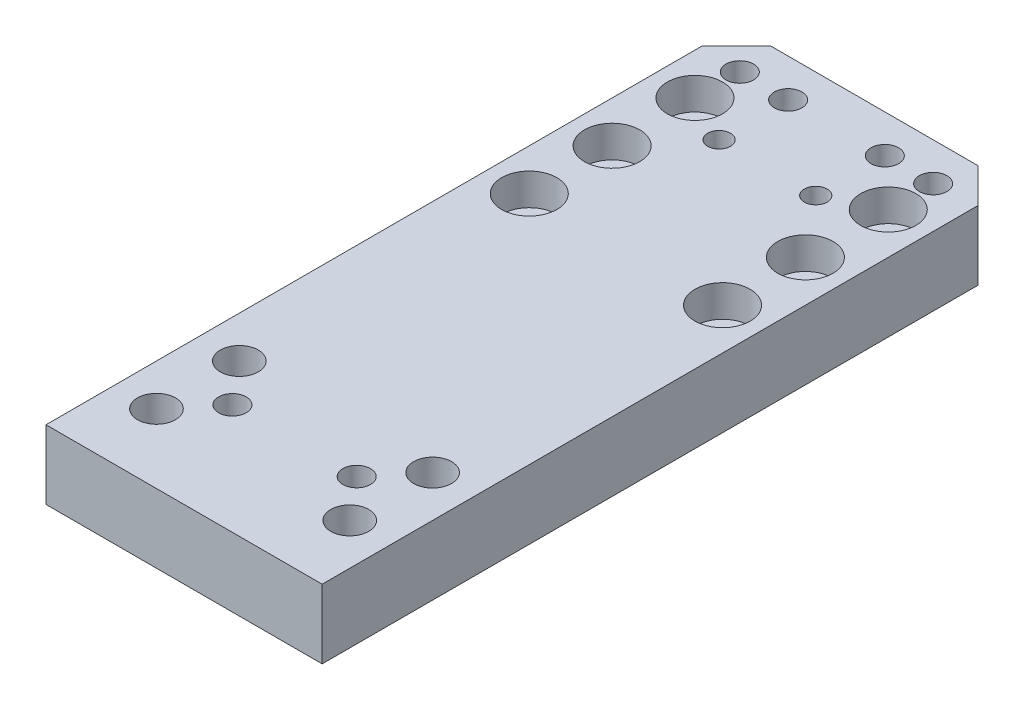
ISO-10303-21;
HEADER;
FILE_DESCRIPTION(('STEP AP214'),'2;1');
FILE_NAME('part.step','',(''),(''),'','','');
FILE_SCHEMA(('AUTOMOTIVE_DESIGN { 1 0 10303 214 1 1 1 1 }'));
ENDSEC;
DATA;
#1=APPLICATION_CONTEXT('core data for automotive mechanical design processes');
#2=APPLICATION_PROTOCOL_DEFINITION('international standard','automotive_design',2000,#1);
#3=PRODUCT_CONTEXT('',#1,'mechanical');
#4=PRODUCT('Part','Part','',(#3));
#5=PRODUCT_RELATED_PRODUCT_CATEGORY('part','',(#4));
#6=PRODUCT_DEFINITION_FORMATION('','',#4);
#7=PRODUCT_DEFINITION_CONTEXT('part definition',#1,'design');
#8=PRODUCT_DEFINITION('design','',#6,#7);
#9=PRODUCT_DEFINITION_SHAPE('','',#8);
#10=(LENGTH_UNIT() NAMED_UNIT(*) SI_UNIT(.MILLI.,.METRE.));
#11=(NAMED_UNIT(*) PLANE_ANGLE_UNIT() SI_UNIT($,.RADIAN.));
#12=(NAMED_UNIT(*) SI_UNIT($,.STERADIAN.) SOLID_ANGLE_UNIT());
#13=UNCERTAINTY_MEASURE_WITH_UNIT(LENGTH_MEASURE(1.E-05),#10,'distance_accuracy_value','');
#14=(GEOMETRIC_REPRESENTATION_CONTEXT(3) GLOBAL_UNCERTAINTY_ASSIGNED_CONTEXT((#13)) GLOBAL_UNIT_ASSIGNED_CONTEXT((#10,
#11,#12)) REPRESENTATION_CONTEXT('',''));
#15=CARTESIAN_POINT('',(0.,0.,0.));
#16=DIRECTION('',(0.,0.,1.));
#17=DIRECTION('',(1.,0.,0.));
#18=AXIS2_PLACEMENT_3D('',#15,#16,#17);
#19=CARTESIAN_POINT('',(20.,10.,-75.));
#20=DIRECTION('',(-1.,0.,0.));
#21=DIRECTION('',(0.,0.,1.));
#22=AXIS2_PLACEMENT_3D('',#19,#20,#21);
#23=PLANE('',#22);
#24=DIRECTION('',(0.,0.,-1.));
#25=VECTOR('',#24,1.);
#26=CARTESIAN_POINT('',(20.,10.,-75.));
#27=LINE('',#26,#25);
#28=CARTESIAN_POINT('',(20.,10.,65.));
#29=VERTEX_POINT('',#28);
#30=CARTESIAN_POINT('',(20.,10.,-30.));
#31=VERTEX_POINT('',#30);
#32=EDGE_CURVE('E80',#29,#31,#27,.T.);
#33=ORIENTED_EDGE('',*,*,#32,.F.);
#34=DIRECTION('',(0.,1.,0.));
#35=VECTOR('',#34,1.);
#36=CARTESIAN_POINT('',(20.,0.,65.));
#37=LINE('',#36,#35);
#38=CARTESIAN_POINT('',(20.,0.,65.));
#39=VERTEX_POINT('',#38);
#40=EDGE_CURVE('E69',#39,#29,#37,.T.);
#41=ORIENTED_EDGE('',*,*,#40,.F.);
#42=DIRECTION('',(0.,0.,-1.));
#43=VECTOR('',#42,1.);
#44=CARTESIAN_POINT('',(20.,0.,-75.));
#45=LINE('',#44,#43);
#46=CARTESIAN_POINT('',(20.,0.,-30.));
#47=VERTEX_POINT('',#46);
#48=EDGE_CURVE('E78',#39,#47,#45,.T.);
#49=ORIENTED_EDGE('',*,*,#48,.T.);
#50=DIRECTION('',(0.,1.,0.));
#51=VECTOR('',#50,1.);
#52=CARTESIAN_POINT('',(20.,10.,-30.));
#53=LINE('',#52,#51);
#54=EDGE_CURVE('E99',#47,#31,#53,.T.);
#55=ORIENTED_EDGE('',*,*,#54,.T.);
#56=EDGE_LOOP('',(#33,#41,#49,#55));
#57=FACE_BOUND('',#56,.T.);
#58=ADVANCED_FACE('F16',(#57),#23,.F.);
#59=CARTESIAN_POINT('',(-20.,10.,-75.));
#60=DIRECTION('',(1.,0.,0.));
#61=DIRECTION('',(0.,0.,-1.));
#62=AXIS2_PLACEMENT_3D('',#59,#60,#61);
#63=PLANE('',#62);
#64=DIRECTION('',(0.,0.,1.));
#65=VECTOR('',#64,1.);
#66=CARTESIAN_POINT('',(-20.,0.,-75.));
#67=LINE('',#66,#65);
#68=CARTESIAN_POINT('',(-20.,0.,-30.));
#69=VERTEX_POINT('',#68);
#70=CARTESIAN_POINT('',(-20.,0.,65.));
#71=VERTEX_POINT('',#70);
#72=EDGE_CURVE('E86',#69,#71,#67,.T.);
#73=ORIENTED_EDGE('',*,*,#72,.T.);
#74=DIRECTION('',(0.,1.,0.));
#75=VECTOR('',#74,1.);
#76=CARTESIAN_POINT('',(-20.,0.,65.));
#77=LINE('',#76,#75);
#78=CARTESIAN_POINT('',(-20.,10.,65.));
#79=VERTEX_POINT('',#78);
#80=EDGE_CURVE('E31',#71,#79,#77,.T.);
#81=ORIENTED_EDGE('',*,*,#80,.T.);
#82=DIRECTION('',(0.,0.,1.));
#83=VECTOR('',#82,1.);
#84=CARTESIAN_POINT('',(-20.,10.,-75.));
#85=LINE('',#84,#83);
#86=CARTESIAN_POINT('',(-20.,10.,-30.));
#87=VERTEX_POINT('',#86);
#88=EDGE_CURVE('E94',#87,#79,#85,.T.);
#89=ORIENTED_EDGE('',*,*,#88,.F.);
#90=DIRECTION('',(0.,-1.,0.));
#91=VECTOR('',#90,1.);
#92=CARTESIAN_POINT('',(-20.,10.,-30.));
#93=LINE('',#92,#91);
#94=EDGE_CURVE('E11',#87,#69,#93,.T.);
#95=ORIENTED_EDGE('',*,*,#94,.T.);
#96=EDGE_LOOP('',(#73,#81,#89,#95));
#97=FACE_BOUND('',#96,.T.);
#98=ADVANCED_FACE('F123',(#97),#63,.F.);
#99=CARTESIAN_POINT('',(0.,10.,0.));
#100=DIRECTION('',(0.,1.,0.));
#101=DIRECTION('',(0.,0.,1.));
#102=AXIS2_PLACEMENT_3D('',#99,#100,#101);
#103=PLANE('',#102);
#104=CARTESIAN_POINT('',(14.,10.,-29.5000000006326));
#105=DIRECTION('',(0.,1.,0.));
#106=DIRECTION('',(0.,0.,1.));
#107=AXIS2_PLACEMENT_3D('',#104,#105,#106);
#108=CIRCLE('',#107,2.);
#109=CARTESIAN_POINT('',(14.,10.,-27.5000000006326));
#110=VERTEX_POINT('',#109);
#111=EDGE_CURVE('E292',#110,#110,#108,.T.);
#112=ORIENTED_EDGE('',*,*,#111,.F.);
#113=EDGE_LOOP('',(#112));
#114=FACE_BOUND('',#113,.T.);
#115=CARTESIAN_POINT('',(-14.,10.,-29.5000000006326));
#116=DIRECTION('',(0.,1.,0.));
#117=DIRECTION('',(0.,0.,1.));
#118=AXIS2_PLACEMENT_3D('',#115,#116,#117);
#119=CIRCLE('',#118,2.);
#120=CARTESIAN_POINT('',(-14.,10.,-27.5000000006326));
#121=VERTEX_POINT('',#120);
#122=EDGE_CURVE('E286',#121,#121,#119,.T.);
#123=ORIENTED_EDGE('',*,*,#122,.F.);
#124=EDGE_LOOP('',(#123));
#125=FACE_BOUND('',#124,.T.);
#126=CARTESIAN_POINT('',(14.,10.,1.));
#127=DIRECTION('',(0.,1.,0.));
#128=DIRECTION('',(0.,0.,1.));
#129=AXIS2_PLACEMENT_3D('',#126,#127,#128);
#130=CIRCLE('',#129,4.);
#131=CARTESIAN_POINT('',(14.,10.,5.));
#132=VERTEX_POINT('',#131);
#133=EDGE_CURVE('E280',#132,#132,#130,.T.);
#134=ORIENTED_EDGE('',*,*,#133,.F.);
#135=EDGE_LOOP('',(#134));
#136=FACE_BOUND('',#135,.T.);
#137=CARTESIAN_POINT('',(-14.,10.,1.));
#138=DIRECTION('',(0.,1.,0.));
#139=DIRECTION('',(0.,0.,1.));
#140=AXIS2_PLACEMENT_3D('',#137,#138,#139);
#141=CIRCLE('',#140,4.);
#142=CARTESIAN_POINT('',(-14.,10.,5.));
#143=VERTEX_POINT('',#142);
#144=EDGE_CURVE('E268',#143,#143,#141,.T.);
#145=ORIENTED_EDGE('',*,*,#144,.F.);
#146=EDGE_LOOP('',(#145));
#147=FACE_BOUND('',#146,.T.);
#148=CARTESIAN_POINT('',(-14.,10.,-11.));
#149=DIRECTION('',(0.,1.,0.));
#150=DIRECTION('',(0.,0.,1.));
#151=AXIS2_PLACEMENT_3D('',#148,#149,#150);
#152=CIRCLE('',#151,4.);
#153=CARTESIAN_POINT('',(-14.,10.,-7.));
#154=VERTEX_POINT('',#153);
#155=EDGE_CURVE('E256',#154,#154,#152,.T.);
#156=ORIENTED_EDGE('',*,*,#155,.F.);
#157=EDGE_LOOP('',(#156));
#158=FACE_BOUND('',#157,.T.);
#159=CARTESIAN_POINT('',(14.,10.,-11.));
#160=DIRECTION('',(0.,1.,0.));
#161=DIRECTION('',(0.,0.,1.));
#162=AXIS2_PLACEMENT_3D('',#159,#160,#161);
#163=CIRCLE('',#162,4.);
#164=CARTESIAN_POINT('',(14.,10.,-7.));
#165=VERTEX_POINT('',#164);
#166=EDGE_CURVE('E244',#165,#165,#163,.T.);
#167=ORIENTED_EDGE('',*,*,#166,.F.);
#168=EDGE_LOOP('',(#167));
#169=FACE_BOUND('',#168,.T.);
#170=CARTESIAN_POINT('',(14.,10.,-23.));
#171=DIRECTION('',(0.,1.,0.));
#172=DIRECTION('',(0.,0.,1.));
#173=AXIS2_PLACEMENT_3D('',#170,#171,#172);
#174=CIRCLE('',#173,4.);
#175=CARTESIAN_POINT('',(14.,10.,-19.));
#176=VERTEX_POINT('',#175);
#177=EDGE_CURVE('E232',#176,#176,#174,.T.);
#178=ORIENTED_EDGE('',*,*,#177,.F.);
#179=EDGE_LOOP('',(#178));
#180=FACE_BOUND('',#179,.T.);
#181=CARTESIAN_POINT('',(-14.,10.,-23.));
#182=DIRECTION('',(0.,1.,0.));
#183=DIRECTION('',(0.,0.,1.));
#184=AXIS2_PLACEMENT_3D('',#181,#182,#183);
#185=CIRCLE('',#184,4.);
#186=CARTESIAN_POINT('',(-14.,10.,-19.));
#187=VERTEX_POINT('',#186);
#188=EDGE_CURVE('E220',#187,#187,#185,.T.);
#189=ORIENTED_EDGE('',*,*,#188,.F.);
#190=EDGE_LOOP('',(#189));
#191=FACE_BOUND('',#190,.T.);
#192=DIRECTION('',(-1.,0.,0.));
#193=VECTOR('',#192,1.);
#194=CARTESIAN_POINT('',(-20.,10.,65.));
#195=LINE('',#194,#193);
#196=EDGE_CURVE('E73',#29,#79,#195,.T.);
#197=ORIENTED_EDGE('',*,*,#196,.F.);
#198=ORIENTED_EDGE('',*,*,#32,.T.);
#199=DIRECTION('',(0.707106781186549,0.,0.707106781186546));
#200=VECTOR('',#199,1.);
#201=CARTESIAN_POINT('',(25.,10.,-25.));
#202=LINE('',#201,#200);
#203=CARTESIAN_POINT('',(15.,10.,-35.));
#204=VERTEX_POINT('',#203);
#205=EDGE_CURVE('E103',#31,#204,#202,.F.);
#206=ORIENTED_EDGE('',*,*,#205,.T.);
#207=DIRECTION('',(1.,0.,0.));
#208=VECTOR('',#207,1.);
#209=CARTESIAN_POINT('',(-20.,10.,-35.));
#210=LINE('',#209,#208);
#211=CARTESIAN_POINT('',(-15.,10.,-35.));
#212=VERTEX_POINT('',#211);
#213=EDGE_CURVE('E87',#212,#204,#210,.T.);
#214=ORIENTED_EDGE('',*,*,#213,.F.);
#215=DIRECTION('',(0.707106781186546,0.,-0.707106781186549));
#216=VECTOR('',#215,1.);
#217=CARTESIAN_POINT('',(-25.,10.,-25.));
#218=LINE('',#217,#216);
#219=EDGE_CURVE('E101',#212,#87,#218,.F.);
#220=ORIENTED_EDGE('',*,*,#219,.T.);
#221=ORIENTED_EDGE('',*,*,#88,.T.);
#222=EDGE_LOOP('',(#197,#198,#206,#214,#220,#221));
#223=FACE_BOUND('',#222,.T.);
#224=CARTESIAN_POINT('',(7.,10.,-29.5000000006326));
#225=DIRECTION('',(0.,1.,0.));
#226=DIRECTION('',(0.,0.,1.));
#227=AXIS2_PLACEMENT_3D('',#224,#225,#226);
#228=CIRCLE('',#227,2.);
#229=CARTESIAN_POINT('',(7.,10.,-27.5000000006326));
#230=VERTEX_POINT('',#229);
#231=EDGE_CURVE('E206',#230,#230,#228,.T.);
#232=ORIENTED_EDGE('',*,*,#231,.F.);
#233=EDGE_LOOP('',(#232));
#234=FACE_BOUND('',#233,.T.);
#235=CARTESIAN_POINT('',(-7.,10.,-29.5000000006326));
#236=DIRECTION('',(0.,1.,0.));
#237=DIRECTION('',(0.,0.,1.));
#238=AXIS2_PLACEMENT_3D('',#235,#236,#237);
#239=CIRCLE('',#238,2.);
#240=CARTESIAN_POINT('',(-7.,10.,-27.5000000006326));
#241=VERTEX_POINT('',#240);
#242=EDGE_CURVE('E200',#241,#241,#239,.T.);
#243=ORIENTED_EDGE('',*,*,#242,.F.);
#244=EDGE_LOOP('',(#243));
#245=FACE_BOUND('',#244,.T.);
#246=CARTESIAN_POINT('',(7.,10.,-19.5000000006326));
#247=DIRECTION('',(0.,1.,0.));
#248=DIRECTION('',(0.,0.,1.));
#249=AXIS2_PLACEMENT_3D('',#246,#247,#248);
#250=CIRCLE('',#249,1.65);
#251=CARTESIAN_POINT('',(7.,10.,-17.8500000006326));
#252=VERTEX_POINT('',#251);
#253=EDGE_CURVE('E194',#252,#252,#250,.T.);
#254=ORIENTED_EDGE('',*,*,#253,.F.);
#255=EDGE_LOOP('',(#254));
#256=FACE_BOUND('',#255,.T.);
#257=CARTESIAN_POINT('',(-7.,10.,-19.5000000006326));
#258=DIRECTION('',(0.,1.,0.));
#259=DIRECTION('',(0.,0.,1.));
#260=AXIS2_PLACEMENT_3D('',#257,#258,#259);
#261=CIRCLE('',#260,1.65);
#262=CARTESIAN_POINT('',(-7.,10.,-17.8500000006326));
#263=VERTEX_POINT('',#262);
#264=EDGE_CURVE('E188',#263,#263,#261,.T.);
#265=ORIENTED_EDGE('',*,*,#264,.F.);
#266=EDGE_LOOP('',(#265));
#267=FACE_BOUND('',#266,.T.);
#268=CARTESIAN_POINT('',(14.,10.,55.));
#269=DIRECTION('',(0.,-1.,0.));
#270=DIRECTION('',(0.,0.,-1.));
#271=AXIS2_PLACEMENT_3D('',#268,#269,#270);
#272=CIRCLE('',#271,2.75);
#273=CARTESIAN_POINT('',(14.,10.,52.25));
#274=VERTEX_POINT('',#273);
#275=EDGE_CURVE('E173',#274,#274,#272,.T.);
#276=ORIENTED_EDGE('',*,*,#275,.T.);
#277=EDGE_LOOP('',(#276));
#278=FACE_BOUND('',#277,.T.);
#279=CARTESIAN_POINT('',(-14.,10.,55.));
#280=DIRECTION('',(0.,-1.,0.));
#281=DIRECTION('',(0.,0.,-1.));
#282=AXIS2_PLACEMENT_3D('',#279,#280,#281);
#283=CIRCLE('',#282,2.75);
#284=CARTESIAN_POINT('',(-14.,10.,52.25));
#285=VERTEX_POINT('',#284);
#286=EDGE_CURVE('E161',#285,#285,#283,.T.);
#287=ORIENTED_EDGE('',*,*,#286,.T.);
#288=EDGE_LOOP('',(#287));
#289=FACE_BOUND('',#288,.T.);
#290=CARTESIAN_POINT('',(14.,10.,43.));
#291=DIRECTION('',(0.,-1.,0.));
#292=DIRECTION('',(0.,0.,-1.));
#293=AXIS2_PLACEMENT_3D('',#290,#291,#292);
#294=CIRCLE('',#293,2.75);
#295=CARTESIAN_POINT('',(14.,10.,40.25));
#296=VERTEX_POINT('',#295);
#297=EDGE_CURVE('E149',#296,#296,#294,.T.);
#298=ORIENTED_EDGE('',*,*,#297,.T.);
#299=EDGE_LOOP('',(#298));
#300=FACE_BOUND('',#299,.T.);
#301=CARTESIAN_POINT('',(-14.,10.,43.));
#302=DIRECTION('',(0.,-1.,0.));
#303=DIRECTION('',(0.,0.,-1.));
#304=AXIS2_PLACEMENT_3D('',#301,#302,#303);
#305=CIRCLE('',#304,2.75);
#306=CARTESIAN_POINT('',(-14.,10.,40.25));
#307=VERTEX_POINT('',#306);
#308=EDGE_CURVE('E137',#307,#307,#305,.T.);
#309=ORIENTED_EDGE('',*,*,#308,.T.);
#310=EDGE_LOOP('',(#309));
#311=FACE_BOUND('',#310,.T.);
#312=CARTESIAN_POINT('',(9.,10.,49.));
#313=DIRECTION('',(0.,1.,0.));
#314=DIRECTION('',(0.,0.,1.));
#315=AXIS2_PLACEMENT_3D('',#312,#313,#314);
#316=CIRCLE('',#315,2.);
#317=CARTESIAN_POINT('',(9.,10.,51.));
#318=VERTEX_POINT('',#317);
#319=EDGE_CURVE('E134',#318,#318,#316,.T.);
#320=ORIENTED_EDGE('',*,*,#319,.F.);
#321=EDGE_LOOP('',(#320));
#322=FACE_BOUND('',#321,.T.);
#323=CARTESIAN_POINT('',(-9.,10.,49.));
#324=DIRECTION('',(0.,1.,0.));
#325=DIRECTION('',(0.,0.,1.));
#326=AXIS2_PLACEMENT_3D('',#323,#324,#325);
#327=CIRCLE('',#326,2.);
#328=CARTESIAN_POINT('',(-9.,10.,51.));
#329=VERTEX_POINT('',#328);
#330=EDGE_CURVE('E128',#329,#329,#327,.T.);
#331=ORIENTED_EDGE('',*,*,#330,.F.);
#332=EDGE_LOOP('',(#331));
#333=FACE_BOUND('',#332,.T.);
#334=ADVANCED_FACE('F121',(#114,#125,#136,#147,#158,#169,#180,#191,#223,#234,#245,#256,#267,
#278,#289,#300,#311,#322,#333),#103,.T.);
#335=CARTESIAN_POINT('',(0.,0.,0.));
#336=DIRECTION('',(0.,1.,0.));
#337=DIRECTION('',(0.,0.,1.));
#338=AXIS2_PLACEMENT_3D('',#335,#336,#337);
#339=PLANE('',#338);
#340=CARTESIAN_POINT('',(14.,0.,-29.5000000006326));
#341=DIRECTION('',(0.,1.,0.));
#342=DIRECTION('',(0.,0.,1.));
#343=AXIS2_PLACEMENT_3D('',#340,#341,#342);
#344=CIRCLE('',#343,2.);
#345=CARTESIAN_POINT('',(14.,0.,-27.5000000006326));
#346=VERTEX_POINT('',#345);
#347=EDGE_CURVE('E289',#346,#346,#344,.T.);
#348=ORIENTED_EDGE('',*,*,#347,.T.);
#349=EDGE_LOOP('',(#348));
#350=FACE_BOUND('',#349,.T.);
#351=CARTESIAN_POINT('',(-14.,0.,-29.5000000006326));
#352=DIRECTION('',(0.,1.,0.));
#353=DIRECTION('',(0.,0.,1.));
#354=AXIS2_PLACEMENT_3D('',#351,#352,#353);
#355=CIRCLE('',#354,2.);
#356=CARTESIAN_POINT('',(-14.,0.,-27.5000000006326));
#357=VERTEX_POINT('',#356);
#358=EDGE_CURVE('E283',#357,#357,#355,.T.);
#359=ORIENTED_EDGE('',*,*,#358,.T.);
#360=EDGE_LOOP('',(#359));
#361=FACE_BOUND('',#360,.T.);
#362=CARTESIAN_POINT('',(14.,0.,1.));
#363=DIRECTION('',(0.,1.,0.));
#364=DIRECTION('',(0.,0.,1.));
#365=AXIS2_PLACEMENT_3D('',#362,#363,#364);
#366=CIRCLE('',#365,2.25);
#367=CARTESIAN_POINT('',(14.,0.,3.25));
#368=VERTEX_POINT('',#367);
#369=EDGE_CURVE('E271',#368,#368,#366,.T.);
#370=ORIENTED_EDGE('',*,*,#369,.T.);
#371=EDGE_LOOP('',(#370));
#372=FACE_BOUND('',#371,.T.);
#373=CARTESIAN_POINT('',(-14.,0.,1.));
#374=DIRECTION('',(0.,1.,0.));
#375=DIRECTION('',(0.,0.,1.));
#376=AXIS2_PLACEMENT_3D('',#373,#374,#375);
#377=CIRCLE('',#376,2.25);
#378=CARTESIAN_POINT('',(-14.,0.,3.25));
#379=VERTEX_POINT('',#378);
#380=EDGE_CURVE('E259',#379,#379,#377,.T.);
#381=ORIENTED_EDGE('',*,*,#380,.T.);
#382=EDGE_LOOP('',(#381));
#383=FACE_BOUND('',#382,.T.);
#384=CARTESIAN_POINT('',(-14.,0.,-11.));
#385=DIRECTION('',(0.,1.,0.));
#386=DIRECTION('',(0.,0.,1.));
#387=AXIS2_PLACEMENT_3D('',#384,#385,#386);
#388=CIRCLE('',#387,2.25);
#389=CARTESIAN_POINT('',(-14.,0.,-8.75));
#390=VERTEX_POINT('',#389);
#391=EDGE_CURVE('E247',#390,#390,#388,.T.);
#392=ORIENTED_EDGE('',*,*,#391,.T.);
#393=EDGE_LOOP('',(#392));
#394=FACE_BOUND('',#393,.T.);
#395=CARTESIAN_POINT('',(14.,0.,-11.));
#396=DIRECTION('',(0.,1.,0.));
#397=DIRECTION('',(0.,0.,1.));
#398=AXIS2_PLACEMENT_3D('',#395,#396,#397);
#399=CIRCLE('',#398,2.25);
#400=CARTESIAN_POINT('',(14.,0.,-8.75));
#401=VERTEX_POINT('',#400);
#402=EDGE_CURVE('E235',#401,#401,#399,.T.);
#403=ORIENTED_EDGE('',*,*,#402,.T.);
#404=EDGE_LOOP('',(#403));
#405=FACE_BOUND('',#404,.T.);
#406=CARTESIAN_POINT('',(14.,0.,-23.));
#407=DIRECTION('',(0.,1.,0.));
#408=DIRECTION('',(0.,0.,1.));
#409=AXIS2_PLACEMENT_3D('',#406,#407,#408);
#410=CIRCLE('',#409,2.25);
#411=CARTESIAN_POINT('',(14.,0.,-20.75));
#412=VERTEX_POINT('',#411);
#413=EDGE_CURVE('E223',#412,#412,#410,.T.);
#414=ORIENTED_EDGE('',*,*,#413,.T.);
#415=EDGE_LOOP('',(#414));
#416=FACE_BOUND('',#415,.T.);
#417=CARTESIAN_POINT('',(-14.,0.,-23.));
#418=DIRECTION('',(0.,1.,0.));
#419=DIRECTION('',(0.,0.,1.));
#420=AXIS2_PLACEMENT_3D('',#417,#418,#419);
#421=CIRCLE('',#420,2.25);
#422=CARTESIAN_POINT('',(-14.,0.,-20.75));
#423=VERTEX_POINT('',#422);
#424=EDGE_CURVE('E210',#423,#423,#421,.T.);
#425=ORIENTED_EDGE('',*,*,#424,.T.);
#426=EDGE_LOOP('',(#425));
#427=FACE_BOUND('',#426,.T.);
#428=CARTESIAN_POINT('',(7.,0.,-29.5000000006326));
#429=DIRECTION('',(0.,1.,0.));
#430=DIRECTION('',(0.,0.,1.));
#431=AXIS2_PLACEMENT_3D('',#428,#429,#430);
#432=CIRCLE('',#431,2.);
#433=CARTESIAN_POINT('',(7.,0.,-27.5000000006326));
#434=VERTEX_POINT('',#433);
#435=EDGE_CURVE('E203',#434,#434,#432,.T.);
#436=ORIENTED_EDGE('',*,*,#435,.T.);
#437=EDGE_LOOP('',(#436));
#438=FACE_BOUND('',#437,.T.);
#439=CARTESIAN_POINT('',(-7.,0.,-29.5000000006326));
#440=DIRECTION('',(0.,1.,0.));
#441=DIRECTION('',(0.,0.,1.));
#442=AXIS2_PLACEMENT_3D('',#439,#440,#441);
#443=CIRCLE('',#442,2.);
#444=CARTESIAN_POINT('',(-7.,0.,-27.5000000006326));
#445=VERTEX_POINT('',#444);
#446=EDGE_CURVE('E197',#445,#445,#443,.T.);
#447=ORIENTED_EDGE('',*,*,#446,.T.);
#448=EDGE_LOOP('',(#447));
#449=FACE_BOUND('',#448,.T.);
#450=CARTESIAN_POINT('',(7.,0.,-19.5000000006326));
#451=DIRECTION('',(0.,1.,0.));
#452=DIRECTION('',(0.,0.,1.));
#453=AXIS2_PLACEMENT_3D('',#450,#451,#452);
#454=CIRCLE('',#453,1.65);
#455=CARTESIAN_POINT('',(7.,0.,-17.8500000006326));
#456=VERTEX_POINT('',#455);
#457=EDGE_CURVE('E191',#456,#456,#454,.T.);
#458=ORIENTED_EDGE('',*,*,#457,.T.);
#459=EDGE_LOOP('',(#458));
#460=FACE_BOUND('',#459,.T.);
#461=CARTESIAN_POINT('',(-7.,0.,-19.5000000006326));
#462=DIRECTION('',(0.,1.,0.));
#463=DIRECTION('',(0.,0.,1.));
#464=AXIS2_PLACEMENT_3D('',#461,#462,#463);
#465=CIRCLE('',#464,1.65);
#466=CARTESIAN_POINT('',(-7.,0.,-17.8500000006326));
#467=VERTEX_POINT('',#466);
#468=EDGE_CURVE('E185',#467,#467,#465,.T.);
#469=ORIENTED_EDGE('',*,*,#468,.T.);
#470=EDGE_LOOP('',(#469));
#471=FACE_BOUND('',#470,.T.);
#472=CARTESIAN_POINT('',(14.,0.,55.));
#473=DIRECTION('',(0.,-1.,0.));
#474=DIRECTION('',(0.,0.,-1.));
#475=AXIS2_PLACEMENT_3D('',#472,#473,#474);
#476=CIRCLE('',#475,4.75);
#477=CARTESIAN_POINT('',(14.,0.,50.25));
#478=VERTEX_POINT('',#477);
#479=EDGE_CURVE('E182',#478,#478,#476,.T.);
#480=ORIENTED_EDGE('',*,*,#479,.F.);
#481=EDGE_LOOP('',(#480));
#482=FACE_BOUND('',#481,.T.);
#483=CARTESIAN_POINT('',(-14.,0.,55.));
#484=DIRECTION('',(0.,-1.,0.));
#485=DIRECTION('',(0.,0.,-1.));
#486=AXIS2_PLACEMENT_3D('',#483,#484,#485);
#487=CIRCLE('',#486,4.75);
#488=CARTESIAN_POINT('',(-14.,0.,50.25));
#489=VERTEX_POINT('',#488);
#490=EDGE_CURVE('E170',#489,#489,#487,.T.);
#491=ORIENTED_EDGE('',*,*,#490,.F.);
#492=EDGE_LOOP('',(#491));
#493=FACE_BOUND('',#492,.T.);
#494=CARTESIAN_POINT('',(14.,0.,43.));
#495=DIRECTION('',(0.,-1.,0.));
#496=DIRECTION('',(0.,0.,-1.));
#497=AXIS2_PLACEMENT_3D('',#494,#495,#496);
#498=CIRCLE('',#497,4.75);
#499=CARTESIAN_POINT('',(14.,0.,38.25));
#500=VERTEX_POINT('',#499);
#501=EDGE_CURVE('E158',#500,#500,#498,.T.);
#502=ORIENTED_EDGE('',*,*,#501,.F.);
#503=EDGE_LOOP('',(#502));
#504=FACE_BOUND('',#503,.T.);
#505=CARTESIAN_POINT('',(-14.,0.,43.));
#506=DIRECTION('',(0.,-1.,0.));
#507=DIRECTION('',(0.,0.,-1.));
#508=AXIS2_PLACEMENT_3D('',#505,#506,#507);
#509=CIRCLE('',#508,4.75);
#510=CARTESIAN_POINT('',(-14.,0.,38.25));
#511=VERTEX_POINT('',#510);
#512=EDGE_CURVE('E146',#511,#511,#509,.T.);
#513=ORIENTED_EDGE('',*,*,#512,.F.);
#514=EDGE_LOOP('',(#513));
#515=FACE_BOUND('',#514,.T.);
#516=CARTESIAN_POINT('',(9.,0.,49.));
#517=DIRECTION('',(0.,1.,0.));
#518=DIRECTION('',(0.,0.,1.));
#519=AXIS2_PLACEMENT_3D('',#516,#517,#518);
#520=CIRCLE('',#519,2.);
#521=CARTESIAN_POINT('',(9.,0.,51.));
#522=VERTEX_POINT('',#521);
#523=EDGE_CURVE('E131',#522,#522,#520,.T.);
#524=ORIENTED_EDGE('',*,*,#523,.T.);
#525=EDGE_LOOP('',(#524));
#526=FACE_BOUND('',#525,.T.);
#527=CARTESIAN_POINT('',(-9.,0.,49.));
#528=DIRECTION('',(0.,1.,0.));
#529=DIRECTION('',(0.,0.,1.));
#530=AXIS2_PLACEMENT_3D('',#527,#528,#529);
#531=CIRCLE('',#530,2.);
#532=CARTESIAN_POINT('',(-9.,0.,51.));
#533=VERTEX_POINT('',#532);
#534=EDGE_CURVE('E91',#533,#533,#531,.T.);
#535=ORIENTED_EDGE('',*,*,#534,.T.);
#536=EDGE_LOOP('',(#535));
#537=FACE_BOUND('',#536,.T.);
#538=ORIENTED_EDGE('',*,*,#48,.F.);
#539=DIRECTION('',(-1.,0.,0.));
#540=VECTOR('',#539,1.);
#541=CARTESIAN_POINT('',(-20.,0.,65.));
#542=LINE('',#541,#540);
#543=EDGE_CURVE('E66',#39,#71,#542,.T.);
#544=ORIENTED_EDGE('',*,*,#543,.T.);
#545=ORIENTED_EDGE('',*,*,#72,.F.);
#546=DIRECTION('',(-0.707106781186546,0.,0.707106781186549));
#547=VECTOR('',#546,1.);
#548=CARTESIAN_POINT('',(-15.,0.,-35.));
#549=LINE('',#548,#547);
#550=CARTESIAN_POINT('',(-15.,0.,-35.));
#551=VERTEX_POINT('',#550);
#552=EDGE_CURVE('E110',#69,#551,#549,.F.);
#553=ORIENTED_EDGE('',*,*,#552,.T.);
#554=DIRECTION('',(1.,0.,0.));
#555=VECTOR('',#554,1.);
#556=CARTESIAN_POINT('',(0.,0.,-35.));
#557=LINE('',#556,#555);
#558=CARTESIAN_POINT('',(15.,0.,-35.));
#559=VERTEX_POINT('',#558);
#560=EDGE_CURVE('E97',#551,#559,#557,.T.);
#561=ORIENTED_EDGE('',*,*,#560,.T.);
#562=DIRECTION('',(-0.707106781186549,0.,-0.707106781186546));
#563=VECTOR('',#562,1.);
#564=CARTESIAN_POINT('',(20.,0.,-30.));
#565=LINE('',#564,#563);
#566=EDGE_CURVE('E24',#559,#47,#565,.F.);
#567=ORIENTED_EDGE('',*,*,#566,.T.);
#568=EDGE_LOOP('',(#538,#544,#545,#553,#561,#567));
#569=FACE_BOUND('',#568,.T.);
#570=ADVANCED_FACE('F82',(#350,#361,#372,#383,#394,#405,#416,#427,#438,#449,#460,#471,#482,#493,
#504,#515,#526,#537,#569),#339,.F.);
#571=CARTESIAN_POINT('',(-20.,-23.,-35.));
#572=DIRECTION('',(0.,0.,1.));
#573=DIRECTION('',(1.,0.,0.));
#574=AXIS2_PLACEMENT_3D('',#571,#572,#573);
#575=PLANE('',#574);
#576=ORIENTED_EDGE('',*,*,#213,.T.);
#577=DIRECTION('',(0.,-1.,0.));
#578=VECTOR('',#577,1.);
#579=CARTESIAN_POINT('',(15.,-23.,-35.));
#580=LINE('',#579,#578);
#581=EDGE_CURVE('E108',#204,#559,#580,.T.);
#582=ORIENTED_EDGE('',*,*,#581,.T.);
#583=ORIENTED_EDGE('',*,*,#560,.F.);
#584=DIRECTION('',(0.,1.,0.));
#585=VECTOR('',#584,1.);
#586=CARTESIAN_POINT('',(-15.,-23.,-35.));
#587=LINE('',#586,#585);
#588=EDGE_CURVE('E105',#551,#212,#587,.T.);
#589=ORIENTED_EDGE('',*,*,#588,.T.);
#590=EDGE_LOOP('',(#576,#582,#583,#589));
#591=FACE_BOUND('',#590,.T.);
#592=ADVANCED_FACE('F116',(#591),#575,.F.);
#593=CARTESIAN_POINT('',(-9.,10.,49.));
#594=DIRECTION('',(0.,1.,0.));
#595=DIRECTION('',(0.,0.,1.));
#596=AXIS2_PLACEMENT_3D('',#593,#594,#595);
#597=CYLINDRICAL_SURFACE('',#596,2.);
#598=ORIENTED_EDGE('',*,*,#534,.F.);
#599=EDGE_LOOP('',(#598));
#600=FACE_BOUND('',#599,.T.);
#601=ORIENTED_EDGE('',*,*,#330,.T.);
#602=EDGE_LOOP('',(#601));
#603=FACE_BOUND('',#602,.T.);
#604=ADVANCED_FACE('F424',(#600,#603),#597,.F.);
#605=CARTESIAN_POINT('',(9.,10.,49.));
#606=DIRECTION('',(0.,1.,0.));
#607=DIRECTION('',(0.,0.,1.));
#608=AXIS2_PLACEMENT_3D('',#605,#606,#607);
#609=CYLINDRICAL_SURFACE('',#608,2.);
#610=ORIENTED_EDGE('',*,*,#523,.F.);
#611=EDGE_LOOP('',(#610));
#612=FACE_BOUND('',#611,.T.);
#613=ORIENTED_EDGE('',*,*,#319,.T.);
#614=EDGE_LOOP('',(#613));
#615=FACE_BOUND('',#614,.T.);
#616=ADVANCED_FACE('F420',(#612,#615),#609,.F.);
#617=CARTESIAN_POINT('',(-14.,0.,43.));
#618=DIRECTION('',(0.,-1.,0.));
#619=DIRECTION('',(0.,0.,-1.));
#620=AXIS2_PLACEMENT_3D('',#617,#618,#619);
#621=CYLINDRICAL_SURFACE('',#620,2.75);
#622=ORIENTED_EDGE('',*,*,#308,.F.);
#623=EDGE_LOOP('',(#622));
#624=FACE_BOUND('',#623,.T.);
#625=CARTESIAN_POINT('',(-14.,5.5,43.));
#626=DIRECTION('',(0.,-1.,0.));
#627=DIRECTION('',(0.,0.,-1.));
#628=AXIS2_PLACEMENT_3D('',#625,#626,#627);
#629=CIRCLE('',#628,2.75);
#630=CARTESIAN_POINT('',(-14.,5.5,40.25));
#631=VERTEX_POINT('',#630);
#632=EDGE_CURVE('E140',#631,#631,#629,.T.);
#633=ORIENTED_EDGE('',*,*,#632,.T.);
#634=EDGE_LOOP('',(#633));
#635=FACE_BOUND('',#634,.T.);
#636=ADVANCED_FACE('F416',(#624,#635),#621,.F.);
#637=CARTESIAN_POINT('',(-11.25,5.5,43.));
#638=DIRECTION('',(0.,1.,0.));
#639=DIRECTION('',(0.,0.,1.));
#640=AXIS2_PLACEMENT_3D('',#637,#638,#639);
#641=PLANE('',#640);
#642=ORIENTED_EDGE('',*,*,#632,.F.);
#643=EDGE_LOOP('',(#642));
#644=FACE_BOUND('',#643,.T.);
#645=CARTESIAN_POINT('',(-14.,5.5,43.));
#646=DIRECTION('',(0.,-1.,0.));
#647=DIRECTION('',(0.,0.,-1.));
#648=AXIS2_PLACEMENT_3D('',#645,#646,#647);
#649=CIRCLE('',#648,4.75);
#650=CARTESIAN_POINT('',(-14.,5.5,38.25));
#651=VERTEX_POINT('',#650);
#652=EDGE_CURVE('E143',#651,#651,#649,.T.);
#653=ORIENTED_EDGE('',*,*,#652,.T.);
#654=EDGE_LOOP('',(#653));
#655=FACE_BOUND('',#654,.T.);
#656=ADVANCED_FACE('F412',(#644,#655),#641,.F.);
#657=CARTESIAN_POINT('',(-14.,0.,43.));
#658=DIRECTION('',(0.,-1.,0.));
#659=DIRECTION('',(0.,0.,-1.));
#660=AXIS2_PLACEMENT_3D('',#657,#658,#659);
#661=CYLINDRICAL_SURFACE('',#660,4.75);
#662=ORIENTED_EDGE('',*,*,#652,.F.);
#663=EDGE_LOOP('',(#662));
#664=FACE_BOUND('',#663,.T.);
#665=ORIENTED_EDGE('',*,*,#512,.T.);
#666=EDGE_LOOP('',(#665));
#667=FACE_BOUND('',#666,.T.);
#668=ADVANCED_FACE('F408',(#664,#667),#661,.F.);
#669=CARTESIAN_POINT('',(14.,0.,43.));
#670=DIRECTION('',(0.,-1.,0.));
#671=DIRECTION('',(0.,0.,-1.));
#672=AXIS2_PLACEMENT_3D('',#669,#670,#671);
#673=CYLINDRICAL_SURFACE('',#672,2.75);
#674=ORIENTED_EDGE('',*,*,#297,.F.);
#675=EDGE_LOOP('',(#674));
#676=FACE_BOUND('',#675,.T.);
#677=CARTESIAN_POINT('',(14.,5.5,43.));
#678=DIRECTION('',(0.,-1.,0.));
#679=DIRECTION('',(0.,0.,-1.));
#680=AXIS2_PLACEMENT_3D('',#677,#678,#679);
#681=CIRCLE('',#680,2.75);
#682=CARTESIAN_POINT('',(14.,5.5,40.25));
#683=VERTEX_POINT('',#682);
#684=EDGE_CURVE('E152',#683,#683,#681,.T.);
#685=ORIENTED_EDGE('',*,*,#684,.T.);
#686=EDGE_LOOP('',(#685));
#687=FACE_BOUND('',#686,.T.);
#688=ADVANCED_FACE('F404',(#676,#687),#673,.F.);
#689=CARTESIAN_POINT('',(16.75,5.5,43.));
#690=DIRECTION('',(0.,1.,0.));
#691=DIRECTION('',(0.,0.,1.));
#692=AXIS2_PLACEMENT_3D('',#689,#690,#691);
#693=PLANE('',#692);
#694=ORIENTED_EDGE('',*,*,#684,.F.);
#695=EDGE_LOOP('',(#694));
#696=FACE_BOUND('',#695,.T.);
#697=CARTESIAN_POINT('',(14.,5.5,43.));
#698=DIRECTION('',(0.,-1.,0.));
#699=DIRECTION('',(0.,0.,-1.));
#700=AXIS2_PLACEMENT_3D('',#697,#698,#699);
#701=CIRCLE('',#700,4.75);
#702=CARTESIAN_POINT('',(14.,5.5,38.25));
#703=VERTEX_POINT('',#702);
#704=EDGE_CURVE('E155',#703,#703,#701,.T.);
#705=ORIENTED_EDGE('',*,*,#704,.T.);
#706=EDGE_LOOP('',(#705));
#707=FACE_BOUND('',#706,.T.);
#708=ADVANCED_FACE('F400',(#696,#707),#693,.F.);
#709=CARTESIAN_POINT('',(14.,0.,43.));
#710=DIRECTION('',(0.,-1.,0.));
#711=DIRECTION('',(0.,0.,-1.));
#712=AXIS2_PLACEMENT_3D('',#709,#710,#711);
#713=CYLINDRICAL_SURFACE('',#712,4.75);
#714=ORIENTED_EDGE('',*,*,#704,.F.);
#715=EDGE_LOOP('',(#714));
#716=FACE_BOUND('',#715,.T.);
#717=ORIENTED_EDGE('',*,*,#501,.T.);
#718=EDGE_LOOP('',(#717));
#719=FACE_BOUND('',#718,.T.);
#720=ADVANCED_FACE('F396',(#716,#719),#713,.F.);
#721=CARTESIAN_POINT('',(-14.,0.,55.));
#722=DIRECTION('',(0.,-1.,0.));
#723=DIRECTION('',(0.,0.,-1.));
#724=AXIS2_PLACEMENT_3D('',#721,#722,#723);
#725=CYLINDRICAL_SURFACE('',#724,2.75);
#726=ORIENTED_EDGE('',*,*,#286,.F.);
#727=EDGE_LOOP('',(#726));
#728=FACE_BOUND('',#727,.T.);
#729=CARTESIAN_POINT('',(-14.,5.5,55.));
#730=DIRECTION('',(0.,-1.,0.));
#731=DIRECTION('',(0.,0.,-1.));
#732=AXIS2_PLACEMENT_3D('',#729,#730,#731);
#733=CIRCLE('',#732,2.75);
#734=CARTESIAN_POINT('',(-14.,5.5,52.25));
#735=VERTEX_POINT('',#734);
#736=EDGE_CURVE('E164',#735,#735,#733,.T.);
#737=ORIENTED_EDGE('',*,*,#736,.T.);
#738=EDGE_LOOP('',(#737));
#739=FACE_BOUND('',#738,.T.);
#740=ADVANCED_FACE('F392',(#728,#739),#725,.F.);
#741=CARTESIAN_POINT('',(-11.25,5.5,55.));
#742=DIRECTION('',(0.,1.,0.));
#743=DIRECTION('',(0.,0.,1.));
#744=AXIS2_PLACEMENT_3D('',#741,#742,#743);
#745=PLANE('',#744);
#746=ORIENTED_EDGE('',*,*,#736,.F.);
#747=EDGE_LOOP('',(#746));
#748=FACE_BOUND('',#747,.T.);
#749=CARTESIAN_POINT('',(-14.,5.5,55.));
#750=DIRECTION('',(0.,-1.,0.));
#751=DIRECTION('',(0.,0.,-1.));
#752=AXIS2_PLACEMENT_3D('',#749,#750,#751);
#753=CIRCLE('',#752,4.75);
#754=CARTESIAN_POINT('',(-14.,5.5,50.25));
#755=VERTEX_POINT('',#754);
#756=EDGE_CURVE('E167',#755,#755,#753,.T.);
#757=ORIENTED_EDGE('',*,*,#756,.T.);
#758=EDGE_LOOP('',(#757));
#759=FACE_BOUND('',#758,.T.);
#760=ADVANCED_FACE('F388',(#748,#759),#745,.F.);
#761=CARTESIAN_POINT('',(-14.,0.,55.));
#762=DIRECTION('',(0.,-1.,0.));
#763=DIRECTION('',(0.,0.,-1.));
#764=AXIS2_PLACEMENT_3D('',#761,#762,#763);
#765=CYLINDRICAL_SURFACE('',#764,4.75);
#766=ORIENTED_EDGE('',*,*,#756,.F.);
#767=EDGE_LOOP('',(#766));
#768=FACE_BOUND('',#767,.T.);
#769=ORIENTED_EDGE('',*,*,#490,.T.);
#770=EDGE_LOOP('',(#769));
#771=FACE_BOUND('',#770,.T.);
#772=ADVANCED_FACE('F384',(#768,#771),#765,.F.);
#773=CARTESIAN_POINT('',(14.,0.,55.));
#774=DIRECTION('',(0.,-1.,0.));
#775=DIRECTION('',(0.,0.,-1.));
#776=AXIS2_PLACEMENT_3D('',#773,#774,#775);
#777=CYLINDRICAL_SURFACE('',#776,2.75);
#778=ORIENTED_EDGE('',*,*,#275,.F.);
#779=EDGE_LOOP('',(#778));
#780=FACE_BOUND('',#779,.T.);
#781=CARTESIAN_POINT('',(14.,5.5,55.));
#782=DIRECTION('',(0.,-1.,0.));
#783=DIRECTION('',(0.,0.,-1.));
#784=AXIS2_PLACEMENT_3D('',#781,#782,#783);
#785=CIRCLE('',#784,2.75);
#786=CARTESIAN_POINT('',(14.,5.5,52.25));
#787=VERTEX_POINT('',#786);
#788=EDGE_CURVE('E176',#787,#787,#785,.T.);
#789=ORIENTED_EDGE('',*,*,#788,.T.);
#790=EDGE_LOOP('',(#789));
#791=FACE_BOUND('',#790,.T.);
#792=ADVANCED_FACE('F380',(#780,#791),#777,.F.);
#793=CARTESIAN_POINT('',(16.75,5.5,55.));
#794=DIRECTION('',(0.,1.,0.));
#795=DIRECTION('',(0.,0.,1.));
#796=AXIS2_PLACEMENT_3D('',#793,#794,#795);
#797=PLANE('',#796);
#798=ORIENTED_EDGE('',*,*,#788,.F.);
#799=EDGE_LOOP('',(#798));
#800=FACE_BOUND('',#799,.T.);
#801=CARTESIAN_POINT('',(14.,5.5,55.));
#802=DIRECTION('',(0.,-1.,0.));
#803=DIRECTION('',(0.,0.,-1.));
#804=AXIS2_PLACEMENT_3D('',#801,#802,#803);
#805=CIRCLE('',#804,4.75);
#806=CARTESIAN_POINT('',(14.,5.5,50.25));
#807=VERTEX_POINT('',#806);
#808=EDGE_CURVE('E179',#807,#807,#805,.T.);
#809=ORIENTED_EDGE('',*,*,#808,.T.);
#810=EDGE_LOOP('',(#809));
#811=FACE_BOUND('',#810,.T.);
#812=ADVANCED_FACE('F376',(#800,#811),#797,.F.);
#813=CARTESIAN_POINT('',(14.,0.,55.));
#814=DIRECTION('',(0.,-1.,0.));
#815=DIRECTION('',(0.,0.,-1.));
#816=AXIS2_PLACEMENT_3D('',#813,#814,#815);
#817=CYLINDRICAL_SURFACE('',#816,4.75);
#818=ORIENTED_EDGE('',*,*,#808,.F.);
#819=EDGE_LOOP('',(#818));
#820=FACE_BOUND('',#819,.T.);
#821=ORIENTED_EDGE('',*,*,#479,.T.);
#822=EDGE_LOOP('',(#821));
#823=FACE_BOUND('',#822,.T.);
#824=ADVANCED_FACE('F372',(#820,#823),#817,.F.);
#825=CARTESIAN_POINT('',(-7.,10.,-19.5000000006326));
#826=DIRECTION('',(0.,1.,0.));
#827=DIRECTION('',(0.,0.,1.));
#828=AXIS2_PLACEMENT_3D('',#825,#826,#827);
#829=CYLINDRICAL_SURFACE('',#828,1.65);
#830=ORIENTED_EDGE('',*,*,#468,.F.);
#831=EDGE_LOOP('',(#830));
#832=FACE_BOUND('',#831,.T.);
#833=ORIENTED_EDGE('',*,*,#264,.T.);
#834=EDGE_LOOP('',(#833));
#835=FACE_BOUND('',#834,.T.);
#836=ADVANCED_FACE('F368',(#832,#835),#829,.F.);
#837=CARTESIAN_POINT('',(7.,10.,-19.5000000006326));
#838=DIRECTION('',(0.,1.,0.));
#839=DIRECTION('',(0.,0.,1.));
#840=AXIS2_PLACEMENT_3D('',#837,#838,#839);
#841=CYLINDRICAL_SURFACE('',#840,1.65);
#842=ORIENTED_EDGE('',*,*,#457,.F.);
#843=EDGE_LOOP('',(#842));
#844=FACE_BOUND('',#843,.T.);
#845=ORIENTED_EDGE('',*,*,#253,.T.);
#846=EDGE_LOOP('',(#845));
#847=FACE_BOUND('',#846,.T.);
#848=ADVANCED_FACE('F358',(#844,#847),#841,.F.);
#849=CARTESIAN_POINT('',(-7.,10.,-29.5000000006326));
#850=DIRECTION('',(0.,1.,0.));
#851=DIRECTION('',(0.,0.,1.));
#852=AXIS2_PLACEMENT_3D('',#849,#850,#851);
#853=CYLINDRICAL_SURFACE('',#852,2.);
#854=ORIENTED_EDGE('',*,*,#446,.F.);
#855=EDGE_LOOP('',(#854));
#856=FACE_BOUND('',#855,.T.);
#857=ORIENTED_EDGE('',*,*,#242,.T.);
#858=EDGE_LOOP('',(#857));
#859=FACE_BOUND('',#858,.T.);
#860=ADVANCED_FACE('F351',(#856,#859),#853,.F.);
#861=CARTESIAN_POINT('',(7.,10.,-29.5000000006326));
#862=DIRECTION('',(0.,1.,0.));
#863=DIRECTION('',(0.,0.,1.));
#864=AXIS2_PLACEMENT_3D('',#861,#862,#863);
#865=CYLINDRICAL_SURFACE('',#864,2.);
#866=ORIENTED_EDGE('',*,*,#435,.F.);
#867=EDGE_LOOP('',(#866));
#868=FACE_BOUND('',#867,.T.);
#869=ORIENTED_EDGE('',*,*,#231,.T.);
#870=EDGE_LOOP('',(#869));
#871=FACE_BOUND('',#870,.T.);
#872=ADVANCED_FACE('F344',(#868,#871),#865,.F.);
#873=CARTESIAN_POINT('',(20.,10.,-30.));
#874=DIRECTION('',(-0.707106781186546,0.,0.707106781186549));
#875=DIRECTION('',(0.,1.,0.));
#876=AXIS2_PLACEMENT_3D('',#873,#874,#875);
#877=PLANE('',#876);
#878=ORIENTED_EDGE('',*,*,#566,.F.);
#879=ORIENTED_EDGE('',*,*,#581,.F.);
#880=ORIENTED_EDGE('',*,*,#205,.F.);
#881=ORIENTED_EDGE('',*,*,#54,.F.);
#882=EDGE_LOOP('',(#878,#879,#880,#881));
#883=FACE_BOUND('',#882,.T.);
#884=ADVANCED_FACE('F342',(#883),#877,.F.);
#885=CARTESIAN_POINT('',(-15.,-23.,-35.));
#886=DIRECTION('',(0.707106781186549,0.,0.707106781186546));
#887=DIRECTION('',(0.,1.,0.));
#888=AXIS2_PLACEMENT_3D('',#885,#886,#887);
#889=PLANE('',#888);
#890=ORIENTED_EDGE('',*,*,#552,.F.);
#891=ORIENTED_EDGE('',*,*,#94,.F.);
#892=ORIENTED_EDGE('',*,*,#219,.F.);
#893=ORIENTED_EDGE('',*,*,#588,.F.);
#894=EDGE_LOOP('',(#890,#891,#892,#893));
#895=FACE_BOUND('',#894,.T.);
#896=ADVANCED_FACE('F18',(#895),#889,.F.);
#897=CARTESIAN_POINT('',(-20.,0.,65.));
#898=DIRECTION('',(0.,0.,-1.));
#899=DIRECTION('',(-1.,0.,0.));
#900=AXIS2_PLACEMENT_3D('',#897,#898,#899);
#901=PLANE('',#900);
#902=ORIENTED_EDGE('',*,*,#196,.T.);
#903=ORIENTED_EDGE('',*,*,#80,.F.);
#904=ORIENTED_EDGE('',*,*,#543,.F.);
#905=ORIENTED_EDGE('',*,*,#40,.T.);
#906=EDGE_LOOP('',(#902,#903,#904,#905));
#907=FACE_BOUND('',#906,.T.);
#908=ADVANCED_FACE('F68',(#907),#901,.F.);
#909=CARTESIAN_POINT('',(-14.,10.,-23.));
#910=DIRECTION('',(0.,1.,0.));
#911=DIRECTION('',(0.,0.,1.));
#912=AXIS2_PLACEMENT_3D('',#909,#910,#911);
#913=CYLINDRICAL_SURFACE('',#912,2.25);
#914=ORIENTED_EDGE('',*,*,#424,.F.);
#915=EDGE_LOOP('',(#914));
#916=FACE_BOUND('',#915,.T.);
#917=CARTESIAN_POINT('',(-14.,5.4,-23.));
#918=DIRECTION('',(0.,1.,0.));
#919=DIRECTION('',(0.,0.,1.));
#920=AXIS2_PLACEMENT_3D('',#917,#918,#919);
#921=CIRCLE('',#920,2.25);
#922=CARTESIAN_POINT('',(-14.,5.4,-20.75));
#923=VERTEX_POINT('',#922);
#924=EDGE_CURVE('E214',#923,#923,#921,.T.);
#925=ORIENTED_EDGE('',*,*,#924,.T.);
#926=EDGE_LOOP('',(#925));
#927=FACE_BOUND('',#926,.T.);
#928=ADVANCED_FACE('F330',(#916,#927),#913,.F.);
#929=CARTESIAN_POINT('',(-11.75,5.4,-23.));
#930=DIRECTION('',(0.,-1.,0.));
#931=DIRECTION('',(0.,0.,-1.));
#932=AXIS2_PLACEMENT_3D('',#929,#930,#931);
#933=PLANE('',#932);
#934=ORIENTED_EDGE('',*,*,#924,.F.);
#935=EDGE_LOOP('',(#934));
#936=FACE_BOUND('',#935,.T.);
#937=CARTESIAN_POINT('',(-14.,5.4,-23.));
#938=DIRECTION('',(0.,1.,0.));
#939=DIRECTION('',(0.,0.,1.));
#940=AXIS2_PLACEMENT_3D('',#937,#938,#939);
#941=CIRCLE('',#940,4.);
#942=CARTESIAN_POINT('',(-14.,5.4,-19.));
#943=VERTEX_POINT('',#942);
#944=EDGE_CURVE('E217',#943,#943,#941,.T.);
#945=ORIENTED_EDGE('',*,*,#944,.T.);
#946=EDGE_LOOP('',(#945));
#947=FACE_BOUND('',#946,.T.);
#948=ADVANCED_FACE('F318',(#936,#947),#933,.F.);
#949=CARTESIAN_POINT('',(-14.,10.,-23.));
#950=DIRECTION('',(0.,1.,0.));
#951=DIRECTION('',(0.,0.,1.));
#952=AXIS2_PLACEMENT_3D('',#949,#950,#951);
#953=CYLINDRICAL_SURFACE('',#952,4.);
#954=ORIENTED_EDGE('',*,*,#944,.F.);
#955=EDGE_LOOP('',(#954));
#956=FACE_BOUND('',#955,.T.);
#957=ORIENTED_EDGE('',*,*,#188,.T.);
#958=EDGE_LOOP('',(#957));
#959=FACE_BOUND('',#958,.T.);
#960=ADVANCED_FACE('F315',(#956,#959),#953,.F.);
#961=CARTESIAN_POINT('',(14.,10.,-23.));
#962=DIRECTION('',(0.,1.,0.));
#963=DIRECTION('',(0.,0.,1.));
#964=AXIS2_PLACEMENT_3D('',#961,#962,#963);
#965=CYLINDRICAL_SURFACE('',#964,2.25);
#966=ORIENTED_EDGE('',*,*,#413,.F.);
#967=EDGE_LOOP('',(#966));
#968=FACE_BOUND('',#967,.T.);
#969=CARTESIAN_POINT('',(14.,5.4,-23.));
#970=DIRECTION('',(0.,1.,0.));
#971=DIRECTION('',(0.,0.,1.));
#972=AXIS2_PLACEMENT_3D('',#969,#970,#971);
#973=CIRCLE('',#972,2.25);
#974=CARTESIAN_POINT('',(14.,5.4,-20.75));
#975=VERTEX_POINT('',#974);
#976=EDGE_CURVE('E226',#975,#975,#973,.T.);
#977=ORIENTED_EDGE('',*,*,#976,.T.);
#978=EDGE_LOOP('',(#977));
#979=FACE_BOUND('',#978,.T.);
#980=ADVANCED_FACE('F317',(#968,#979),#965,.F.);
#981=CARTESIAN_POINT('',(16.25,5.4,-23.));
#982=DIRECTION('',(0.,-1.,0.));
#983=DIRECTION('',(0.,0.,-1.));
#984=AXIS2_PLACEMENT_3D('',#981,#982,#983);
#985=PLANE('',#984);
#986=ORIENTED_EDGE('',*,*,#976,.F.);
#987=EDGE_LOOP('',(#986));
#988=FACE_BOUND('',#987,.T.);
#989=CARTESIAN_POINT('',(14.,5.4,-23.));
#990=DIRECTION('',(0.,1.,0.));
#991=DIRECTION('',(0.,0.,1.));
#992=AXIS2_PLACEMENT_3D('',#989,#990,#991);
#993=CIRCLE('',#992,4.);
#994=CARTESIAN_POINT('',(14.,5.4,-19.));
#995=VERTEX_POINT('',#994);
#996=EDGE_CURVE('E229',#995,#995,#993,.T.);
#997=ORIENTED_EDGE('',*,*,#996,.T.);
#998=EDGE_LOOP('',(#997));
#999=FACE_BOUND('',#998,.T.);
#1000=ADVANCED_FACE('F327',(#988,#999),#985,.F.);
#1001=CARTESIAN_POINT('',(14.,10.,-23.));
#1002=DIRECTION('',(0.,1.,0.));
#1003=DIRECTION('',(0.,0.,1.));
#1004=AXIS2_PLACEMENT_3D('',#1001,#1002,#1003);
#1005=CYLINDRICAL_SURFACE('',#1004,4.);
#1006=ORIENTED_EDGE('',*,*,#996,.F.);
#1007=EDGE_LOOP('',(#1006));
#1008=FACE_BOUND('',#1007,.T.);
#1009=ORIENTED_EDGE('',*,*,#177,.T.);
#1010=EDGE_LOOP('',(#1009));
#1011=FACE_BOUND('',#1010,.T.);
#1012=ADVANCED_FACE('F702',(#1008,#1011),#1005,.F.);
#1013=CARTESIAN_POINT('',(14.,10.,-11.));
#1014=DIRECTION('',(0.,1.,0.));
#1015=DIRECTION('',(0.,0.,1.));
#1016=AXIS2_PLACEMENT_3D('',#1013,#1014,#1015);
#1017=CYLINDRICAL_SURFACE('',#1016,2.25);
#1018=ORIENTED_EDGE('',*,*,#402,.F.);
#1019=EDGE_LOOP('',(#1018));
#1020=FACE_BOUND('',#1019,.T.);
#1021=CARTESIAN_POINT('',(14.,5.4,-11.));
#1022=DIRECTION('',(0.,1.,0.));
#1023=DIRECTION('',(0.,0.,1.));
#1024=AXIS2_PLACEMENT_3D('',#1021,#1022,#1023);
#1025=CIRCLE('',#1024,2.25);
#1026=CARTESIAN_POINT('',(14.,5.4,-8.75));
#1027=VERTEX_POINT('',#1026);
#1028=EDGE_CURVE('E238',#1027,#1027,#1025,.T.);
#1029=ORIENTED_EDGE('',*,*,#1028,.T.);
#1030=EDGE_LOOP('',(#1029));
#1031=FACE_BOUND('',#1030,.T.);
#1032=ADVANCED_FACE('F710',(#1020,#1031),#1017,.F.);
#1033=CARTESIAN_POINT('',(16.25,5.4,-11.));
#1034=DIRECTION('',(0.,-1.,0.));
#1035=DIRECTION('',(0.,0.,-1.));
#1036=AXIS2_PLACEMENT_3D('',#1033,#1034,#1035);
#1037=PLANE('',#1036);
#1038=ORIENTED_EDGE('',*,*,#1028,.F.);
#1039=EDGE_LOOP('',(#1038));
#1040=FACE_BOUND('',#1039,.T.);
#1041=CARTESIAN_POINT('',(14.,5.4,-11.));
#1042=DIRECTION('',(0.,1.,0.));
#1043=DIRECTION('',(0.,0.,1.));
#1044=AXIS2_PLACEMENT_3D('',#1041,#1042,#1043);
#1045=CIRCLE('',#1044,4.);
#1046=CARTESIAN_POINT('',(14.,5.4,-7.));
#1047=VERTEX_POINT('',#1046);
#1048=EDGE_CURVE('E241',#1047,#1047,#1045,.T.);
#1049=ORIENTED_EDGE('',*,*,#1048,.T.);
#1050=EDGE_LOOP('',(#1049));
#1051=FACE_BOUND('',#1050,.T.);
#1052=ADVANCED_FACE('F718',(#1040,#1051),#1037,.F.);
#1053=CARTESIAN_POINT('',(14.,10.,-11.));
#1054=DIRECTION('',(0.,1.,0.));
#1055=DIRECTION('',(0.,0.,1.));
#1056=AXIS2_PLACEMENT_3D('',#1053,#1054,#1055);
#1057=CYLINDRICAL_SURFACE('',#1056,4.);
#1058=ORIENTED_EDGE('',*,*,#1048,.F.);
#1059=EDGE_LOOP('',(#1058));
#1060=FACE_BOUND('',#1059,.T.);
#1061=ORIENTED_EDGE('',*,*,#166,.T.);
#1062=EDGE_LOOP('',(#1061));
#1063=FACE_BOUND('',#1062,.T.);
#1064=ADVANCED_FACE('F726',(#1060,#1063),#1057,.F.);
#1065=CARTESIAN_POINT('',(-14.,10.,-11.));
#1066=DIRECTION('',(0.,1.,0.));
#1067=DIRECTION('',(0.,0.,1.));
#1068=AXIS2_PLACEMENT_3D('',#1065,#1066,#1067);
#1069=CYLINDRICAL_SURFACE('',#1068,2.25);
#1070=ORIENTED_EDGE('',*,*,#391,.F.);
#1071=EDGE_LOOP('',(#1070));
#1072=FACE_BOUND('',#1071,.T.);
#1073=CARTESIAN_POINT('',(-14.,5.4,-11.));
#1074=DIRECTION('',(0.,1.,0.));
#1075=DIRECTION('',(0.,0.,1.));
#1076=AXIS2_PLACEMENT_3D('',#1073,#1074,#1075);
#1077=CIRCLE('',#1076,2.25);
#1078=CARTESIAN_POINT('',(-14.,5.4,-8.75));
#1079=VERTEX_POINT('',#1078);
#1080=EDGE_CURVE('E250',#1079,#1079,#1077,.T.);
#1081=ORIENTED_EDGE('',*,*,#1080,.T.);
#1082=EDGE_LOOP('',(#1081));
#1083=FACE_BOUND('',#1082,.T.);
#1084=ADVANCED_FACE('F734',(#1072,#1083),#1069,.F.);
#1085=CARTESIAN_POINT('',(-11.75,5.4,-11.));
#1086=DIRECTION('',(0.,-1.,0.));
#1087=DIRECTION('',(0.,0.,-1.));
#1088=AXIS2_PLACEMENT_3D('',#1085,#1086,#1087);
#1089=PLANE('',#1088);
#1090=ORIENTED_EDGE('',*,*,#1080,.F.);
#1091=EDGE_LOOP('',(#1090));
#1092=FACE_BOUND('',#1091,.T.);
#1093=CARTESIAN_POINT('',(-14.,5.4,-11.));
#1094=DIRECTION('',(0.,1.,0.));
#1095=DIRECTION('',(0.,0.,1.));
#1096=AXIS2_PLACEMENT_3D('',#1093,#1094,#1095);
#1097=CIRCLE('',#1096,4.);
#1098=CARTESIAN_POINT('',(-14.,5.4,-7.));
#1099=VERTEX_POINT('',#1098);
#1100=EDGE_CURVE('E253',#1099,#1099,#1097,.T.);
#1101=ORIENTED_EDGE('',*,*,#1100,.T.);
#1102=EDGE_LOOP('',(#1101));
#1103=FACE_BOUND('',#1102,.T.);
#1104=ADVANCED_FACE('F742',(#1092,#1103),#1089,.F.);
#1105=CARTESIAN_POINT('',(-14.,10.,-11.));
#1106=DIRECTION('',(0.,1.,0.));
#1107=DIRECTION('',(0.,0.,1.));
#1108=AXIS2_PLACEMENT_3D('',#1105,#1106,#1107);
#1109=CYLINDRICAL_SURFACE('',#1108,4.);
#1110=ORIENTED_EDGE('',*,*,#1100,.F.);
#1111=EDGE_LOOP('',(#1110));
#1112=FACE_BOUND('',#1111,.T.);
#1113=ORIENTED_EDGE('',*,*,#155,.T.);
#1114=EDGE_LOOP('',(#1113));
#1115=FACE_BOUND('',#1114,.T.);
#1116=ADVANCED_FACE('F750',(#1112,#1115),#1109,.F.);
#1117=CARTESIAN_POINT('',(-14.,10.,1.));
#1118=DIRECTION('',(0.,1.,0.));
#1119=DIRECTION('',(0.,0.,1.));
#1120=AXIS2_PLACEMENT_3D('',#1117,#1118,#1119);
#1121=CYLINDRICAL_SURFACE('',#1120,2.25);
#1122=ORIENTED_EDGE('',*,*,#380,.F.);
#1123=EDGE_LOOP('',(#1122));
#1124=FACE_BOUND('',#1123,.T.);
#1125=CARTESIAN_POINT('',(-14.,5.4,1.));
#1126=DIRECTION('',(0.,1.,0.));
#1127=DIRECTION('',(0.,0.,1.));
#1128=AXIS2_PLACEMENT_3D('',#1125,#1126,#1127);
#1129=CIRCLE('',#1128,2.25);
#1130=CARTESIAN_POINT('',(-14.,5.4,3.25));
#1131=VERTEX_POINT('',#1130);
#1132=EDGE_CURVE('E262',#1131,#1131,#1129,.T.);
#1133=ORIENTED_EDGE('',*,*,#1132,.T.);
#1134=EDGE_LOOP('',(#1133));
#1135=FACE_BOUND('',#1134,.T.);
#1136=ADVANCED_FACE('F758',(#1124,#1135),#1121,.F.);
#1137=CARTESIAN_POINT('',(-11.75,5.4,1.));
#1138=DIRECTION('',(0.,-1.,0.));
#1139=DIRECTION('',(0.,0.,-1.));
#1140=AXIS2_PLACEMENT_3D('',#1137,#1138,#1139);
#1141=PLANE('',#1140);
#1142=ORIENTED_EDGE('',*,*,#1132,.F.);
#1143=EDGE_LOOP('',(#1142));
#1144=FACE_BOUND('',#1143,.T.);
#1145=CARTESIAN_POINT('',(-14.,5.4,1.));
#1146=DIRECTION('',(0.,1.,0.));
#1147=DIRECTION('',(0.,0.,1.));
#1148=AXIS2_PLACEMENT_3D('',#1145,#1146,#1147);
#1149=CIRCLE('',#1148,4.);
#1150=CARTESIAN_POINT('',(-14.,5.4,5.));
#1151=VERTEX_POINT('',#1150);
#1152=EDGE_CURVE('E265',#1151,#1151,#1149,.T.);
#1153=ORIENTED_EDGE('',*,*,#1152,.T.);
#1154=EDGE_LOOP('',(#1153));
#1155=FACE_BOUND('',#1154,.T.);
#1156=ADVANCED_FACE('F766',(#1144,#1155),#1141,.F.);
#1157=CARTESIAN_POINT('',(-14.,10.,1.));
#1158=DIRECTION('',(0.,1.,0.));
#1159=DIRECTION('',(0.,0.,1.));
#1160=AXIS2_PLACEMENT_3D('',#1157,#1158,#1159);
#1161=CYLINDRICAL_SURFACE('',#1160,4.);
#1162=ORIENTED_EDGE('',*,*,#1152,.F.);
#1163=EDGE_LOOP('',(#1162));
#1164=FACE_BOUND('',#1163,.T.);
#1165=ORIENTED_EDGE('',*,*,#144,.T.);
#1166=EDGE_LOOP('',(#1165));
#1167=FACE_BOUND('',#1166,.T.);
#1168=ADVANCED_FACE('F774',(#1164,#1167),#1161,.F.);
#1169=CARTESIAN_POINT('',(14.,10.,1.));
#1170=DIRECTION('',(0.,1.,0.));
#1171=DIRECTION('',(0.,0.,1.));
#1172=AXIS2_PLACEMENT_3D('',#1169,#1170,#1171);
#1173=CYLINDRICAL_SURFACE('',#1172,2.25);
#1174=ORIENTED_EDGE('',*,*,#369,.F.);
#1175=EDGE_LOOP('',(#1174));
#1176=FACE_BOUND('',#1175,.T.);
#1177=CARTESIAN_POINT('',(14.,5.4,1.));
#1178=DIRECTION('',(0.,1.,0.));
#1179=DIRECTION('',(0.,0.,1.));
#1180=AXIS2_PLACEMENT_3D('',#1177,#1178,#1179);
#1181=CIRCLE('',#1180,2.25);
#1182=CARTESIAN_POINT('',(14.,5.4,3.25));
#1183=VERTEX_POINT('',#1182);
#1184=EDGE_CURVE('E274',#1183,#1183,#1181,.T.);
#1185=ORIENTED_EDGE('',*,*,#1184,.T.);
#1186=EDGE_LOOP('',(#1185));
#1187=FACE_BOUND('',#1186,.T.);
#1188=ADVANCED_FACE('F782',(#1176,#1187),#1173,.F.);
#1189=CARTESIAN_POINT('',(16.25,5.4,1.));
#1190=DIRECTION('',(0.,-1.,0.));
#1191=DIRECTION('',(0.,0.,-1.));
#1192=AXIS2_PLACEMENT_3D('',#1189,#1190,#1191);
#1193=PLANE('',#1192);
#1194=ORIENTED_EDGE('',*,*,#1184,.F.);
#1195=EDGE_LOOP('',(#1194));
#1196=FACE_BOUND('',#1195,.T.);
#1197=CARTESIAN_POINT('',(14.,5.4,1.));
#1198=DIRECTION('',(0.,1.,0.));
#1199=DIRECTION('',(0.,0.,1.));
#1200=AXIS2_PLACEMENT_3D('',#1197,#1198,#1199);
#1201=CIRCLE('',#1200,4.);
#1202=CARTESIAN_POINT('',(14.,5.4,5.));
#1203=VERTEX_POINT('',#1202);
#1204=EDGE_CURVE('E277',#1203,#1203,#1201,.T.);
#1205=ORIENTED_EDGE('',*,*,#1204,.T.);
#1206=EDGE_LOOP('',(#1205));
#1207=FACE_BOUND('',#1206,.T.);
#1208=ADVANCED_FACE('F682',(#1196,#1207),#1193,.F.);
#1209=CARTESIAN_POINT('',(14.,10.,1.));
#1210=DIRECTION('',(0.,1.,0.));
#1211=DIRECTION('',(0.,0.,1.));
#1212=AXIS2_PLACEMENT_3D('',#1209,#1210,#1211);
#1213=CYLINDRICAL_SURFACE('',#1212,4.);
#1214=ORIENTED_EDGE('',*,*,#1204,.F.);
#1215=EDGE_LOOP('',(#1214));
#1216=FACE_BOUND('',#1215,.T.);
#1217=ORIENTED_EDGE('',*,*,#133,.T.);
#1218=EDGE_LOOP('',(#1217));
#1219=FACE_BOUND('',#1218,.T.);
#1220=ADVANCED_FACE('F676',(#1216,#1219),#1213,.F.);
#1221=CARTESIAN_POINT('',(-14.,10.,-29.5000000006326));
#1222=DIRECTION('',(0.,1.,0.));
#1223=DIRECTION('',(0.,0.,1.));
#1224=AXIS2_PLACEMENT_3D('',#1221,#1222,#1223);
#1225=CYLINDRICAL_SURFACE('',#1224,2.);
#1226=ORIENTED_EDGE('',*,*,#358,.F.);
#1227=EDGE_LOOP('',(#1226));
#1228=FACE_BOUND('',#1227,.T.);
#1229=ORIENTED_EDGE('',*,*,#122,.T.);
#1230=EDGE_LOOP('',(#1229));
#1231=FACE_BOUND('',#1230,.T.);
#1232=ADVANCED_FACE('F681',(#1228,#1231),#1225,.F.);
#1233=CARTESIAN_POINT('',(14.,10.,-29.5000000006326));
#1234=DIRECTION('',(0.,1.,0.));
#1235=DIRECTION('',(0.,0.,1.));
#1236=AXIS2_PLACEMENT_3D('',#1233,#1234,#1235);
#1237=CYLINDRICAL_SURFACE('',#1236,2.);
#1238=ORIENTED_EDGE('',*,*,#347,.F.);
#1239=EDGE_LOOP('',(#1238));
#1240=FACE_BOUND('',#1239,.T.);
#1241=ORIENTED_EDGE('',*,*,#111,.T.);
#1242=EDGE_LOOP('',(#1241));
#1243=FACE_BOUND('',#1242,.T.);
#1244=ADVANCED_FACE('F296',(#1240,#1243),#1237,.F.);
#1245=CLOSED_SHELL('',(#58,#98,#334,#570,#592,#604,#616,#636,#656,#668,#688,#708,#720,#740,#760,
#772,#792,#812,#824,#836,#848,#860,#872,#884,#896,#908,#928,#948,#960,#980,#1000,#1012,#1032,
#1052,#1064,#1084,#1104,#1116,#1136,#1156,#1168,#1188,#1208,#1220,#1232,#1244));
#1246=MANIFOLD_SOLID_BREP('B1',#1245);
#1247=ADVANCED_BREP_SHAPE_REPRESENTATION('',(#18,#1246),#14);
#1248=SHAPE_DEFINITION_REPRESENTATION(#9,#1247);
ENDSEC;
END-ISO-10303-21;
